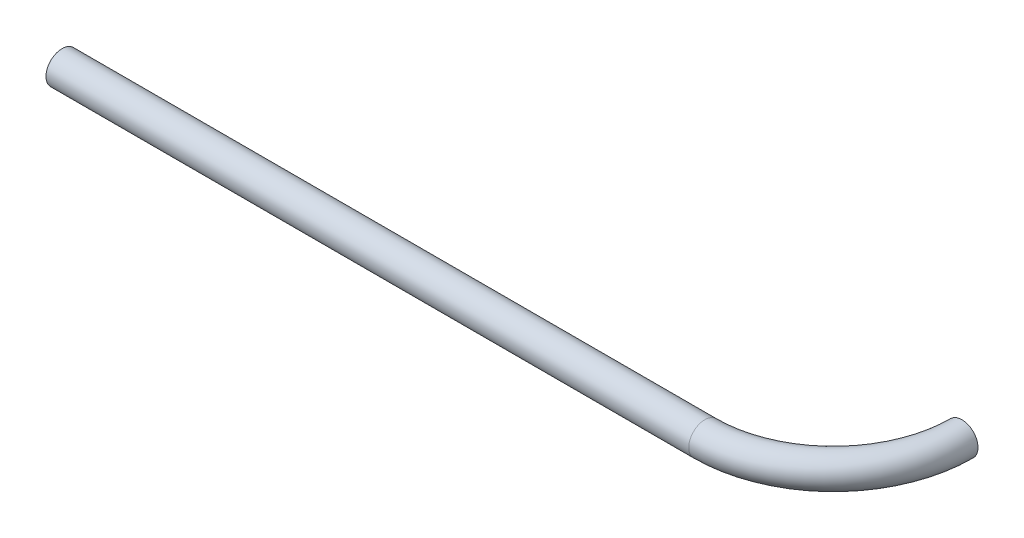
ISO-10303-21;
HEADER;
FILE_DESCRIPTION(('STEP AP214'),'2;1');
FILE_NAME('part.step','',(''),(''),'','','');
FILE_SCHEMA(('AUTOMOTIVE_DESIGN { 1 0 10303 214 1 1 1 1 }'));
ENDSEC;
DATA;
#1=APPLICATION_CONTEXT('core data for automotive mechanical design processes');
#2=APPLICATION_PROTOCOL_DEFINITION('international standard','automotive_design',2000,#1);
#3=PRODUCT_CONTEXT('',#1,'mechanical');
#4=PRODUCT('Part','Part','',(#3));
#5=PRODUCT_RELATED_PRODUCT_CATEGORY('part','',(#4));
#6=PRODUCT_DEFINITION_FORMATION('','',#4);
#7=PRODUCT_DEFINITION_CONTEXT('part definition',#1,'design');
#8=PRODUCT_DEFINITION('design','',#6,#7);
#9=PRODUCT_DEFINITION_SHAPE('','',#8);
#10=(LENGTH_UNIT() NAMED_UNIT(*) SI_UNIT(.MILLI.,.METRE.));
#11=(NAMED_UNIT(*) PLANE_ANGLE_UNIT() SI_UNIT($,.RADIAN.));
#12=(NAMED_UNIT(*) SI_UNIT($,.STERADIAN.) SOLID_ANGLE_UNIT());
#13=UNCERTAINTY_MEASURE_WITH_UNIT(LENGTH_MEASURE(1.E-05),#10,'distance_accuracy_value','');
#14=(GEOMETRIC_REPRESENTATION_CONTEXT(3) GLOBAL_UNCERTAINTY_ASSIGNED_CONTEXT((#13)) GLOBAL_UNIT_ASSIGNED_CONTEXT((#10,
#11,#12)) REPRESENTATION_CONTEXT('',''));
#15=CARTESIAN_POINT('',(0.,0.,0.));
#16=DIRECTION('',(0.,0.,1.));
#17=DIRECTION('',(1.,0.,0.));
#18=AXIS2_PLACEMENT_3D('',#15,#16,#17);
#19=CARTESIAN_POINT('',(254.,0.,-50.8));
#20=DIRECTION('',(0.,1.,0.));
#21=DIRECTION('',(0.,0.,1.));
#22=AXIS2_PLACEMENT_3D('',#19,#20,#21);
#23=TOROIDAL_SURFACE('',#22,50.8,6.35);
#24=CARTESIAN_POINT('',(254.,0.,0.));
#25=DIRECTION('',(1.,0.,0.));
#26=DIRECTION('',(0.,0.,-1.));
#27=AXIS2_PLACEMENT_3D('',#24,#25,#26);
#28=CIRCLE('',#27,6.35);
#29=CARTESIAN_POINT('',(254.,0.,6.34999999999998));
#30=VERTEX_POINT('',#29);
#31=EDGE_CURVE('E34',#30,#30,#28,.T.);
#32=CARTESIAN_POINT('',(304.8,0.,-50.8));
#33=DIRECTION('',(0.,0.,-1.));
#34=DIRECTION('',(-1.,0.,0.));
#35=AXIS2_PLACEMENT_3D('',#32,#33,#34);
#36=CIRCLE('',#35,6.35);
#37=CARTESIAN_POINT('',(311.15,0.,-50.8));
#38=VERTEX_POINT('',#37);
#39=EDGE_CURVE('E10',#38,#38,#36,.T.);
#40=CARTESIAN_POINT('',(254.,0.,-50.8));
#41=DIRECTION('',(0.,1.,0.));
#42=DIRECTION('',(0.,0.,1.));
#43=AXIS2_PLACEMENT_3D('',#40,#41,#42);
#44=CIRCLE('',#43,57.15);
#45=EDGE_CURVE('',#30,#38,#44,.T.);
#46=ORIENTED_EDGE('',*,*,#31,.T.);
#47=ORIENTED_EDGE('',*,*,#39,.F.);
#48=ORIENTED_EDGE('',*,*,#45,.T.);
#49=ORIENTED_EDGE('',*,*,#45,.F.);
#50=EDGE_LOOP('',(#46,#48,#47,#49));
#51=FACE_BOUND('',#50,.T.);
#52=ADVANCED_FACE('F28',(#51),#23,.T.);
#53=CARTESIAN_POINT('',(254.,0.,0.));
#54=DIRECTION('',(-1.,0.,0.));
#55=DIRECTION('',(0.,0.,1.));
#56=AXIS2_PLACEMENT_3D('',#53,#54,#55);
#57=CYLINDRICAL_SURFACE('',#56,6.35);
#58=ORIENTED_EDGE('',*,*,#31,.F.);
#59=EDGE_LOOP('',(#58));
#60=FACE_BOUND('',#59,.T.);
#61=CARTESIAN_POINT('',(0.,0.,0.));
#62=DIRECTION('',(1.,0.,0.));
#63=DIRECTION('',(0.,0.,-1.));
#64=AXIS2_PLACEMENT_3D('',#61,#62,#63);
#65=CIRCLE('',#64,6.35);
#66=CARTESIAN_POINT('',(0.,0.,-6.35));
#67=VERTEX_POINT('',#66);
#68=EDGE_CURVE('E38',#67,#67,#65,.T.);
#69=ORIENTED_EDGE('',*,*,#68,.T.);
#70=EDGE_LOOP('',(#69));
#71=FACE_BOUND('',#70,.T.);
#72=ADVANCED_FACE('F45',(#60,#71),#57,.T.);
#73=CARTESIAN_POINT('',(304.8,0.,-50.8));
#74=DIRECTION('',(0.,0.,-1.));
#75=DIRECTION('',(-1.,0.,0.));
#76=AXIS2_PLACEMENT_3D('',#73,#74,#75);
#77=PLANE('',#76);
#78=ORIENTED_EDGE('',*,*,#39,.T.);
#79=EDGE_LOOP('',(#78));
#80=FACE_BOUND('',#79,.T.);
#81=ADVANCED_FACE('F49',(#80),#77,.T.);
#82=CARTESIAN_POINT('',(0.,0.,0.));
#83=DIRECTION('',(1.,0.,0.));
#84=DIRECTION('',(0.,0.,-1.));
#85=AXIS2_PLACEMENT_3D('',#82,#83,#84);
#86=PLANE('',#85);
#87=ORIENTED_EDGE('',*,*,#68,.F.);
#88=EDGE_LOOP('',(#87));
#89=FACE_BOUND('',#88,.T.);
#90=ADVANCED_FACE('F47',(#89),#86,.F.);
#91=CLOSED_SHELL('',(#52,#72,#81,#90));
#92=MANIFOLD_SOLID_BREP('B2',#91);
#93=ADVANCED_BREP_SHAPE_REPRESENTATION('',(#18,#92),#14);
#94=SHAPE_DEFINITION_REPRESENTATION(#9,#93);
ENDSEC;
END-ISO-10303-21;
